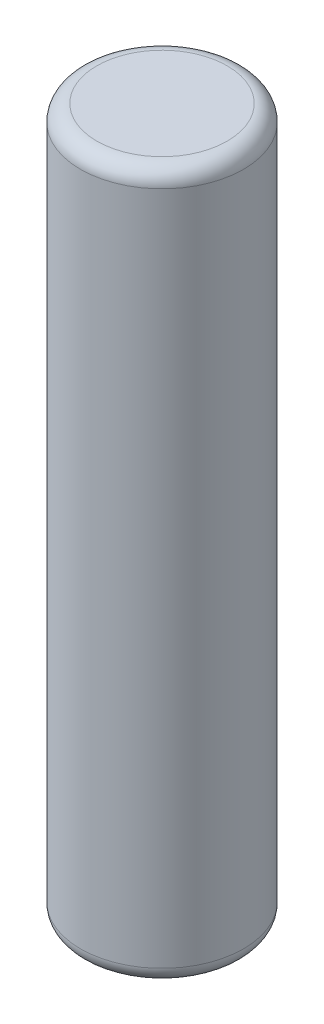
ISO-10303-21;
HEADER;
FILE_DESCRIPTION(('STEP AP214'),'2;1');
FILE_NAME('part.step','',(''),(''),'','','');
FILE_SCHEMA(('AUTOMOTIVE_DESIGN { 1 0 10303 214 1 1 1 1 }'));
ENDSEC;
DATA;
#1=APPLICATION_CONTEXT('core data for automotive mechanical design processes');
#2=APPLICATION_PROTOCOL_DEFINITION('international standard','automotive_design',2000,#1);
#3=PRODUCT_CONTEXT('',#1,'mechanical');
#4=PRODUCT('Part','Part','',(#3));
#5=PRODUCT_RELATED_PRODUCT_CATEGORY('part','',(#4));
#6=PRODUCT_DEFINITION_FORMATION('','',#4);
#7=PRODUCT_DEFINITION_CONTEXT('part definition',#1,'design');
#8=PRODUCT_DEFINITION('design','',#6,#7);
#9=PRODUCT_DEFINITION_SHAPE('','',#8);
#10=(LENGTH_UNIT() NAMED_UNIT(*) SI_UNIT(.MILLI.,.METRE.));
#11=(NAMED_UNIT(*) PLANE_ANGLE_UNIT() SI_UNIT($,.RADIAN.));
#12=(NAMED_UNIT(*) SI_UNIT($,.STERADIAN.) SOLID_ANGLE_UNIT());
#13=UNCERTAINTY_MEASURE_WITH_UNIT(LENGTH_MEASURE(1.E-05),#10,'distance_accuracy_value','');
#14=(GEOMETRIC_REPRESENTATION_CONTEXT(3) GLOBAL_UNCERTAINTY_ASSIGNED_CONTEXT((#13)) GLOBAL_UNIT_ASSIGNED_CONTEXT((#10,
#11,#12)) REPRESENTATION_CONTEXT('',''));
#15=CARTESIAN_POINT('',(0.,0.,0.));
#16=DIRECTION('',(0.,0.,1.));
#17=DIRECTION('',(1.,0.,0.));
#18=AXIS2_PLACEMENT_3D('',#15,#16,#17);
#19=CARTESIAN_POINT('',(0.,10.85,0.));
#20=DIRECTION('',(0.,1.,0.));
#21=DIRECTION('',(0.,0.,1.));
#22=AXIS2_PLACEMENT_3D('',#19,#20,#21);
#23=PLANE('',#22);
#24=CARTESIAN_POINT('',(0.,10.85,0.));
#25=DIRECTION('',(0.,-1.,0.));
#26=DIRECTION('',(0.,0.,-1.));
#27=AXIS2_PLACEMENT_3D('',#24,#25,#26);
#28=CIRCLE('',#27,2.);
#29=CARTESIAN_POINT('',(-1.15089779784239E-07,10.85,-2.));
#30=VERTEX_POINT('',#29);
#31=CARTESIAN_POINT('',(0.,10.85,2.));
#32=VERTEX_POINT('',#31);
#33=EDGE_CURVE('E50',#30,#32,#28,.T.);
#34=ORIENTED_EDGE('',*,*,#33,.F.);
#35=CARTESIAN_POINT('',(0.,10.85,2.));
#36=CARTESIAN_POINT('',(-0.0307999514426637,10.85,2.00000054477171));
#37=CARTESIAN_POINT('',(-0.0615998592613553,10.85,1.99928854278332));
#38=CARTESIAN_POINT('',(-0.123133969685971,10.85,1.99644335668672));
#39=CARTESIAN_POINT('',(-0.153868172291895,10.85,1.99431017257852));
#40=CARTESIAN_POINT('',(-0.215205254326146,10.85,1.98862653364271));
#41=CARTESIAN_POINT('',(-0.245808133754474,10.85,1.98507607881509));
#42=CARTESIAN_POINT('',(-0.306817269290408,10.85,1.97656564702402));
#43=CARTESIAN_POINT('',(-0.337223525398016,10.85,1.97160567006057));
#44=CARTESIAN_POINT('',(-0.397774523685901,10.85,1.96028673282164));
#45=CARTESIAN_POINT('',(-0.42791926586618,10.85,1.95392777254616));
#46=CARTESIAN_POINT('',(-0.487882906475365,10.85,1.93982445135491));
#47=CARTESIAN_POINT('',(-0.517701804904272,10.85,1.93208009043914));
#48=CARTESIAN_POINT('',(-0.576950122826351,10.85,1.91522249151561));
#49=CARTESIAN_POINT('',(-0.606379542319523,10.85,1.90610925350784));
#50=CARTESIAN_POINT('',(-0.66478609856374,10.85,1.8865333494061));
#51=CARTESIAN_POINT('',(-0.693763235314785,10.85,1.87607068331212));
#52=CARTESIAN_POINT('',(-0.751203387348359,10.85,1.8538182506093));
#53=CARTESIAN_POINT('',(-0.779666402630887,10.85,1.84202848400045));
#54=CARTESIAN_POINT('',(-0.83601757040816,10.85,1.81714701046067));
#55=CARTESIAN_POINT('',(-0.863905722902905,10.85,1.80405530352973));
#56=CARTESIAN_POINT('',(-0.919047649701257,10.85,1.77659788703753));
#57=CARTESIAN_POINT('',(-0.946301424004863,10.85,1.76223217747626));
#58=CARTESIAN_POINT('',(-1.00011643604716,10.85,1.732257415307));
#59=CARTESIAN_POINT('',(-1.02667767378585,10.8500000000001,1.71664836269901));
#60=CARTESIAN_POINT('',(-1.07905092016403,10.8499999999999,1.68422021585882));
#61=CARTESIAN_POINT('',(-1.10486292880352,10.8499999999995,1.66740112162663));
#62=CARTESIAN_POINT('',(-1.15568266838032,10.8500000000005,1.63258881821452));
#63=CARTESIAN_POINT('',(-1.18069039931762,10.8500000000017,1.61459560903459));
#64=CARTESIAN_POINT('',(-1.22984808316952,10.8499999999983,1.57747334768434));
#65=CARTESIAN_POINT('',(-1.25399803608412,10.8499999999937,1.55834429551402));
#66=CARTESIAN_POINT('',(-1.30138912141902,10.8500000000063,1.51899164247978));
#67=CARTESIAN_POINT('',(-1.32463025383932,10.8500000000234,1.49876804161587));
#68=CARTESIAN_POINT('',(-1.37015225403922,10.8499999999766,1.45726768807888));
#69=CARTESIAN_POINT('',(-1.39243312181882,10.8499999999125,1.43599093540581));
#70=CARTESIAN_POINT('',(-1.43688215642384,10.850000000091,1.39154816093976));
#71=CARTESIAN_POINT('',(-1.45900867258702,10.8500000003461,1.36834047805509));
#72=CARTESIAN_POINT('',(-1.50213538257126,10.8499999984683,1.32090020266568));
#73=CARTESIAN_POINT('',(-1.52313555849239,10.8499999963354,1.29666759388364));
#74=CARTESIAN_POINT('',(-1.56395781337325,10.8499999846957,1.24722956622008));
#75=CARTESIAN_POINT('',(-1.58377984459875,10.8499999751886,1.2220241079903));
#76=CARTESIAN_POINT('',(-1.62701591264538,10.8499999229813,1.16428316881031));
#77=CARTESIAN_POINT('',(-1.65008889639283,10.8499998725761,1.13149067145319));
#78=CARTESIAN_POINT('',(-1.68536870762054,10.8499997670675,1.077983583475));
#79=CARTESIAN_POINT('',(-1.69822539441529,10.8499997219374,1.05769380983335));
#80=CARTESIAN_POINT('',(-1.72733161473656,10.8499996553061,1.00980591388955));
#81=CARTESIAN_POINT('',(-1.74328379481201,10.8499996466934,0.98202583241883));
#82=CARTESIAN_POINT('',(-1.77378712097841,10.8499996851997,0.925711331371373));
#83=CARTESIAN_POINT('',(-1.78833833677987,10.849999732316,0.897176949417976));
#84=CARTESIAN_POINT('',(-1.81603206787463,10.8499998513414,0.839433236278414));
#85=CARTESIAN_POINT('',(-1.82917475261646,10.8499999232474,0.810223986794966));
#86=CARTESIAN_POINT('',(-1.84772365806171,10.8499999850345,0.765928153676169));
#87=CARTESIAN_POINT('',(-1.8537122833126,10.8499999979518,0.751082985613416));
#88=CARTESIAN_POINT('',(-1.86153325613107,10.8500000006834,0.731220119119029));
#89=CARTESIAN_POINT('',(-1.8634760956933,10.8500000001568,0.726245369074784));
#90=CARTESIAN_POINT('',(-1.87558557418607,10.8499999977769,0.694898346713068));
#91=CARTESIAN_POINT('',(-1.88525804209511,10.8499999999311,0.668332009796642));
#92=CARTESIAN_POINT('',(-1.90388221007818,10.8499999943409,0.613572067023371));
#93=CARTESIAN_POINT('',(-1.91277987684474,10.8499999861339,0.585360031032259));
#94=CARTESIAN_POINT('',(-1.92467876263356,10.849999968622,0.544508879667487));
#95=CARTESIAN_POINT('',(-1.9281869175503,10.8499999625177,0.53201498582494));
#96=CARTESIAN_POINT('',(-1.93954162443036,10.8499999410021,0.48999503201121));
#97=CARTESIAN_POINT('',(-1.94683018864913,10.8499999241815,0.460314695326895));
#98=CARTESIAN_POINT('',(-1.95753458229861,10.8499999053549,0.411889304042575));
#99=CARTESIAN_POINT('',(-1.96137510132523,10.8499999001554,0.393235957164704));
#100=CARTESIAN_POINT('',(-1.97186748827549,10.8499998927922,0.338249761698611));
#101=CARTESIAN_POINT('',(-1.97777111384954,10.8499998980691,0.301770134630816));
#102=CARTESIAN_POINT('',(-1.98655386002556,10.8499999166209,0.235866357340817));
#103=CARTESIAN_POINT('',(-1.98980172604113,10.8499999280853,0.206490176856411));
#104=CARTESIAN_POINT('',(-1.9949805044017,10.8499999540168,0.147622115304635));
#105=CARTESIAN_POINT('',(-1.99691147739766,10.8499999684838,0.118130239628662));
#106=CARTESIAN_POINT('',(-1.99944470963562,10.849999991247,0.0590917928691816));
#107=CARTESIAN_POINT('',(-2.00004705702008,10.8499999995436,0.0295452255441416));
#108=CARTESIAN_POINT('',(-1.99995287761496,10.850000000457,-0.0295860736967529));
#109=CARTESIAN_POINT('',(-1.99925454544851,10.849999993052,-0.0591708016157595));
#110=CARTESIAN_POINT('',(-1.99659363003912,10.8499999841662,-0.11828272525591));
#111=CARTESIAN_POINT('',(-1.99463110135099,10.8499999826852,-0.147809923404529));
#112=CARTESIAN_POINT('',(-1.98941982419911,10.8499999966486,-0.206748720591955));
#113=CARTESIAN_POINT('',(-1.98617105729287,10.8500000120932,-0.236160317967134));
#114=CARTESIAN_POINT('',(-1.97749488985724,10.849999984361,-0.302166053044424));
#115=CARTESIAN_POINT('',(-1.97172584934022,10.84999992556,-0.33871720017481));
#116=CARTESIAN_POINT('',(-1.96273050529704,10.8499998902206,-0.386207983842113));
#117=CARTESIAN_POINT('',(-1.96051255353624,10.8499998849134,-0.397343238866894));
#118=CARTESIAN_POINT('',(-1.95139296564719,10.8499998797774,-0.441075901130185));
#119=CARTESIAN_POINT('',(-1.94373113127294,10.8499999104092,-0.473519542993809));
#120=CARTESIAN_POINT('',(-1.93073337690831,10.8499999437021,-0.523015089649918));
#121=CARTESIAN_POINT('',(-1.9259687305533,10.8499999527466,-0.540220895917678));
#122=CARTESIAN_POINT('',(-1.91356248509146,10.8499999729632,-0.582791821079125));
#123=CARTESIAN_POINT('',(-1.9056442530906,10.8499999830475,-0.608077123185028));
#124=CARTESIAN_POINT('',(-1.88813803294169,10.8499999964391,-0.660323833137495));
#125=CARTESIAN_POINT('',(-1.87846714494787,10.8499999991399,-0.687257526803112));
#126=CARTESIAN_POINT('',(-1.86539159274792,10.8499999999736,-0.721395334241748));
#127=CARTESIAN_POINT('',(-1.86250535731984,10.8499999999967,-0.728800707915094));
#128=CARTESIAN_POINT('',(-1.85367058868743,10.8500000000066,-0.751089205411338));
#129=CARTESIAN_POINT('',(-1.84759179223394,10.8499999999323,-0.765920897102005));
#130=CARTESIAN_POINT('',(-1.82882794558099,10.8500000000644,-0.810191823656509));
#131=CARTESIAN_POINT('',(-1.81561463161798,10.8500000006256,-0.83940909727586));
#132=CARTESIAN_POINT('',(-1.78781952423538,10.8499999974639,-0.89718434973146));
#133=CARTESIAN_POINT('',(-1.77323769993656,10.849999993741,-0.925742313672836));
#134=CARTESIAN_POINT('',(-1.74273157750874,10.8499999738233,-0.982135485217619));
#135=CARTESIAN_POINT('',(-1.72680720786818,10.8499999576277,-1.00997065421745));
#136=CARTESIAN_POINT('',(-1.69780820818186,10.8499998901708,-1.05799798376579));
#137=CARTESIAN_POINT('',(-1.68501598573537,10.8499998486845,-1.07836172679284));
#138=CARTESIAN_POINT('',(-1.64994545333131,10.8499997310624,-1.13198511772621));
#139=CARTESIAN_POINT('',(-1.62701252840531,10.8499996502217,-1.16482160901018));
#140=CARTESIAN_POINT('',(-1.58392733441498,10.8499996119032,-1.22257302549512));
#141=CARTESIAN_POINT('',(-1.56413598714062,10.8499996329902,-1.24775901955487));
#142=CARTESIAN_POINT('',(-1.52334696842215,10.8499997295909,-1.29713448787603));
#143=CARTESIAN_POINT('',(-1.50234940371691,10.8499998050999,-1.32132404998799));
#144=CARTESIAN_POINT('',(-1.45911905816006,10.8499999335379,-1.36856239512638));
#145=CARTESIAN_POINT('',(-1.43688648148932,10.8499999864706,-1.3916113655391));
#146=CARTESIAN_POINT('',(-1.40134319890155,10.8500000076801,-1.42704377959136));
#147=CARTESIAN_POINT('',(-1.3883308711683,10.8500000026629,-1.43973009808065));
#148=CARTESIAN_POINT('',(-1.35976484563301,10.8499999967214,-1.46683969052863));
#149=CARTESIAN_POINT('',(-1.34414996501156,10.8499999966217,-1.48119877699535));
#150=CARTESIAN_POINT('',(-1.3065663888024,10.8499999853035,-1.51468185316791));
#151=CARTESIAN_POINT('',(-1.28440035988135,10.8499999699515,-1.5335852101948));
#152=CARTESIAN_POINT('',(-1.24926888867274,10.8499999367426,-1.56224229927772));
#153=CARTESIAN_POINT('',(-1.23658046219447,10.8499999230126,-1.57233750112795));
#154=CARTESIAN_POINT('',(-1.21188772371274,10.8499998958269,-1.59149256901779));
#155=CARTESIAN_POINT('',(-1.19990045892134,10.8499998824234,-1.60057445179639));
#156=CARTESIAN_POINT('',(-1.15847507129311,10.8499998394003,-1.63122006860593));
#157=CARTESIAN_POINT('',(-1.12853295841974,10.849999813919,-1.65211102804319));
#158=CARTESIAN_POINT('',(-1.07796303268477,10.8499998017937,-1.68533489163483));
#159=CARTESIAN_POINT('',(-1.05765012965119,10.8499998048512,-1.69815205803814));
#160=CARTESIAN_POINT('',(-1.00972466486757,10.8499998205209,-1.72718749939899));
#161=CARTESIAN_POINT('',(-0.981935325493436,10.8499998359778,-1.74311579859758));
#162=CARTESIAN_POINT('',(-0.925617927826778,10.8499998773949,-1.77360117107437));
#163=CARTESIAN_POINT('',(-0.897089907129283,10.8499999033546,-1.78815831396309));
#164=CARTESIAN_POINT('',(-0.839361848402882,10.8499999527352,-1.81587102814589));
#165=CARTESIAN_POINT('',(-0.810161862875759,10.8499999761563,-1.82902670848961));
#166=CARTESIAN_POINT('',(-0.765910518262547,10.8499999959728,-1.84767908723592));
#167=CARTESIAN_POINT('',(-0.751084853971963,10.8500000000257,-1.85371635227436));
#168=CARTESIAN_POINT('',(-0.722428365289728,10.8499999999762,-1.86499055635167));
#169=CARTESIAN_POINT('',(-0.708607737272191,10.8499999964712,-1.87025343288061));
#170=CARTESIAN_POINT('',(-0.666983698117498,10.8499999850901,-1.88559598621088));
#171=CARTESIAN_POINT('',(-0.639014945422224,10.8499999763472,-1.89523091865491));
#172=CARTESIAN_POINT('',(-0.582691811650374,10.8499999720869,-1.91329419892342));
#173=CARTESIAN_POINT('',(-0.554337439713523,10.8499999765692,-1.92172257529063));
#174=CARTESIAN_POINT('',(-0.497288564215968,10.8500000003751,-1.93734012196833));
#175=CARTESIAN_POINT('',(-0.468594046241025,10.8500000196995,-1.94452923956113));
#176=CARTESIAN_POINT('',(-0.418139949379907,10.8499999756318,-1.95607889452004));
#177=CARTESIAN_POINT('',(-0.396439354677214,10.8499999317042,-1.96069732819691));
#178=CARTESIAN_POINT('',(-0.350294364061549,10.8499998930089,-1.96958814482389));
#179=CARTESIAN_POINT('',(-0.325829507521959,10.8499999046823,-1.9737546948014));
#180=CARTESIAN_POINT('',(-0.263993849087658,10.8499999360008,-1.98310930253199));
#181=CARTESIAN_POINT('',(-0.226532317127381,10.8499999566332,-1.98770057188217));
#182=CARTESIAN_POINT('',(-0.147707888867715,10.8499999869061,-1.99509333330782));
#183=CARTESIAN_POINT('',(-0.106324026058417,10.8499999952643,-1.99767409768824));
#184=CARTESIAN_POINT('',(-0.0432752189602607,10.8500000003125,-1.99966843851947));
#185=CARTESIAN_POINT('',(-0.0216364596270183,10.8500000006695,-2.00000613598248));
#186=CARTESIAN_POINT('',(-1.91816298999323E-07,10.85,-2.));
#187=B_SPLINE_CURVE_WITH_KNOTS('',3,(#35,#36,#37,#38,#39,#40,#41,#42,#43,#44,#45,#46,#47,#48,
#49,#50,#51,#52,#53,#54,#55,#56,#57,#58,#59,#60,#61,#62,#63,#64,#65,#66,#67,#68,#69,#70,#71,#72,
#73,#74,#75,#76,#77,#78,#79,#80,#81,#82,#83,#84,#85,#86,#87,#88,#89,#90,#91,#92,#93,#94,#95,#96,
#97,#98,#99,#100,#101,#102,#103,#104,#105,#106,#107,#108,#109,#110,#111,#112,#113,#114,#115,
#116,#117,#118,#119,#120,#121,#122,#123,#124,#125,#126,#127,#128,#129,#130,#131,#132,#133,#134,
#135,#136,#137,#138,#139,#140,#141,#142,#143,#144,#145,#146,#147,#148,#149,#150,#151,#152,#153,
#154,#155,#156,#157,#158,#159,#160,#161,#162,#163,#164,#165,#166,#167,#168,#169,#170,#171,#172,
#173,#174,#175,#176,#177,#178,#179,#180,#181,#182,#183,#184,#185,#186),.UNSPECIFIED.,.F.,.F.,(4,
2,2,2,2,2,2,2,2,2,2,2,2,2,2,2,2,2,2,2,2,2,2,2,2,2,2,2,2,2,2,2,2,2,2,2,2,2,2,2,2,2,2,2,2,2,2,2,2,
2,2,2,2,2,2,2,2,2,2,2,2,2,2,2,2,2,2,2,2,2,2,2,2,2,2,4),(0.,0.0923915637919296,0.184783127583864,
0.277174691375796,0.369566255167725,0.461957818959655,0.554349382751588,0.646740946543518,
0.739132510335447,0.831524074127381,0.923915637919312,1.01630720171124,1.10869876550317,
1.2010903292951,1.29348189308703,1.38587345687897,1.4782650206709,1.57065658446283,
1.66681594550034,1.76297683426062,1.85914161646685,1.97935029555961,2.05139766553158,
2.14745778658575,2.24351312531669,2.33955689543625,2.38757600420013,2.40359807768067,
2.48838908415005,2.57710208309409,2.61603214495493,2.70767819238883,2.76480676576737,
2.87560284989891,2.96424148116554,3.05287602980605,3.14150469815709,3.23025647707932,
3.31900442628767,3.40775364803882,3.51869490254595,3.55275605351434,3.65270998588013,
3.70626575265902,3.78573217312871,3.87155512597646,3.89539871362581,3.94348181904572,
4.03964104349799,4.13580243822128,4.23196895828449,4.30410195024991,4.42417070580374,
4.5202306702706,4.61628214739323,4.71231779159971,4.76683344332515,4.83046301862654,
4.917828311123,4.96646723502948,5.01158185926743,5.12104373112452,5.19308679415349,
5.28913789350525,5.38518411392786,5.48122285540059,5.52924215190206,5.57360546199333,
5.66232172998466,5.75103589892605,5.83975384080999,5.90630053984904,5.98073176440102,
6.0938972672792,6.2182049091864,6.28311682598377),.UNSPECIFIED.);
#188=EDGE_CURVE('E45',#32,#30,#187,.T.);
#189=ORIENTED_EDGE('',*,*,#188,.F.);
#190=EDGE_LOOP('',(#34,#189));
#191=FACE_BOUND('',#190,.T.);
#192=ADVANCED_FACE('F16',(#191),#23,.T.);
#193=CARTESIAN_POINT('',(0.,-10.85,0.));
#194=DIRECTION('',(0.,1.,0.));
#195=DIRECTION('',(0.,0.,1.));
#196=AXIS2_PLACEMENT_3D('',#193,#194,#195);
#197=PLANE('',#196);
#198=CARTESIAN_POINT('',(2.66342503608E-13,-10.85,0.));
#199=DIRECTION('',(0.,1.,0.));
#200=DIRECTION('',(-1.33060229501E-13,0.,1.));
#201=AXIS2_PLACEMENT_3D('',#198,#199,#200);
#202=CIRCLE('',#201,2.00000000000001);
#203=CARTESIAN_POINT('',(0.,-10.85,1.99999999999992));
#204=VERTEX_POINT('',#203);
#205=CARTESIAN_POINT('',(1.7009559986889E-07,-10.85,-2.00000000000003));
#206=VERTEX_POINT('',#205);
#207=EDGE_CURVE('E56',#204,#206,#202,.T.);
#208=ORIENTED_EDGE('',*,*,#207,.F.);
#209=CARTESIAN_POINT('',(2.83492646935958E-07,-10.85,-2.));
#210=CARTESIAN_POINT('',(-0.0273470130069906,-10.8499999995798,-2.00000047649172));
#211=CARTESIAN_POINT('',(-0.0546943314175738,-10.8499999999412,-1.99944420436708));
#212=CARTESIAN_POINT('',(-0.109344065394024,-10.849999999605,-1.99722095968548));
#213=CARTESIAN_POINT('',(-0.136646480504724,-10.8499999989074,-1.99555397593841));
#214=CARTESIAN_POINT('',(-0.191161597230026,-10.8499999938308,-1.99111204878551));
#215=CARTESIAN_POINT('',(-0.218374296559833,-10.8499999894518,-1.98833707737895));
#216=CARTESIAN_POINT('',(-0.272665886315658,-10.8499999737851,-1.98168167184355));
#217=CARTESIAN_POINT('',(-0.299744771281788,-10.8499999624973,-1.97780119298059));
#218=CARTESIAN_POINT('',(-0.346975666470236,-10.8499999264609,-1.97005547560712));
#219=CARTESIAN_POINT('',(-0.367167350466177,-10.849999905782,-1.96642884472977));
#220=CARTESIAN_POINT('',(-0.420874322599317,-10.849999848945,-1.95591550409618));
#221=CARTESIAN_POINT('',(-0.454282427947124,-10.849999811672,-1.94846904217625));
#222=CARTESIAN_POINT('',(-0.514018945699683,-10.8499997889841,-1.93348771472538));
#223=CARTESIAN_POINT('',(-0.540427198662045,-10.8499997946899,-1.92626827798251));
#224=CARTESIAN_POINT('',(-0.592913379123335,-10.8499998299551,-1.91071899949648));
#225=CARTESIAN_POINT('',(-0.61899132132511,-10.8499998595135,-1.9023892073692));
#226=CARTESIAN_POINT('',(-0.67078002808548,-10.8499999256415,-1.88465902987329));
#227=CARTESIAN_POINT('',(-0.696490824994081,-10.8499999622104,-1.87525873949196));
#228=CARTESIAN_POINT('',(-0.734715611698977,-10.8499999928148,-1.86029525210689));
#229=CARTESIAN_POINT('',(-0.747400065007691,-10.8499999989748,-1.85516368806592));
#230=CARTESIAN_POINT('',(-0.763873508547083,-10.8500000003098,-1.84837730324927));
#231=CARTESIAN_POINT('',(-0.76769287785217,-10.8500000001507,-1.84679530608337));
#232=CARTESIAN_POINT('',(-0.79384815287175,-10.849999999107,-1.8358723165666));
#233=CARTESIAN_POINT('',(-0.816030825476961,-10.8499999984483,-1.82616075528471));
#234=CARTESIAN_POINT('',(-0.873124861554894,-10.8499999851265,-1.79991705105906));
#235=CARTESIAN_POINT('',(-0.907753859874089,-10.849999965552,-1.78276573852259));
#236=CARTESIAN_POINT('',(-0.971639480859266,-10.8499999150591,-1.74878005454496));
#237=CARTESIAN_POINT('',(-1.00102137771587,-10.8499998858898,-1.73218027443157));
#238=CARTESIAN_POINT('',(-1.05268007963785,-10.8499998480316,-1.70121434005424));
#239=CARTESIAN_POINT('',(-1.07512798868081,-10.8499998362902,-1.68713378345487));
#240=CARTESIAN_POINT('',(-1.10238695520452,-10.8499998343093,-1.66925391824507));
#241=CARTESIAN_POINT('',(-1.10747927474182,-10.8499998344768,-1.66587950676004));
#242=CARTESIAN_POINT('',(-1.13007142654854,-10.84999983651,-1.65075750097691));
#243=CARTESIAN_POINT('',(-1.14740002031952,-10.8499998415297,-1.63875246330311));
#244=CARTESIAN_POINT('',(-1.18737668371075,-10.8499998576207,-1.61010483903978));
#245=CARTESIAN_POINT('',(-1.20987296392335,-10.8499998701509,-1.59325005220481));
#246=CARTESIAN_POINT('',(-1.25412488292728,-10.8499998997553,-1.55859734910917));
#247=CARTESIAN_POINT('',(-1.27588055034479,-10.8499999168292,-1.54079946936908));
#248=CARTESIAN_POINT('',(-1.31862427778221,-10.8499999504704,-1.504305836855));
#249=CARTESIAN_POINT('',(-1.33961237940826,-10.8499999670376,-1.48561013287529));
#250=CARTESIAN_POINT('',(-1.3807373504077,-10.8499999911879,-1.44730817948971));
#251=CARTESIAN_POINT('',(-1.40087427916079,-10.8499999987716,-1.42770199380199));
#252=CARTESIAN_POINT('',(-1.42828576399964,-10.8500000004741,-1.40004298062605));
#253=CARTESIAN_POINT('',(-1.43586542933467,-10.8500000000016,-1.39228873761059));
#254=CARTESIAN_POINT('',(-1.46399225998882,-10.8499999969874,-1.36303746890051));
#255=CARTESIAN_POINT('',(-1.48412261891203,-10.8499999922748,-1.3411364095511));
#256=CARTESIAN_POINT('',(-1.52542119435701,-10.8499999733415,-1.29415347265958));
#257=CARTESIAN_POINT('',(-1.54648172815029,-10.8499999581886,-1.26897675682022));
#258=CARTESIAN_POINT('',(-1.57197180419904,-10.8499999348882,-1.23692865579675));
#259=CARTESIAN_POINT('',(-1.57699922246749,-10.8499999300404,-1.23052765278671));
#260=CARTESIAN_POINT('',(-1.5988999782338,-10.8499999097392,-1.20228447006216));
#261=CARTESIAN_POINT('',(-1.61535613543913,-10.8499998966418,-1.18011573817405));
#262=CARTESIAN_POINT('',(-1.64652392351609,-10.8499998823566,-1.13623040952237));
#263=CARTESIAN_POINT('',(-1.66128163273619,-10.849999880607,-1.11454649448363));
#264=CARTESIAN_POINT('',(-1.68150211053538,-10.8499998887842,-1.08351358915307));
#265=CARTESIAN_POINT('',(-1.68733193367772,-10.8499998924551,-1.07440218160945));
#266=CARTESIAN_POINT('',(-1.70767963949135,-10.8499999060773,-1.04202200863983));
#267=CARTESIAN_POINT('',(-1.72179255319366,-10.8499999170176,-1.01849737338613));
#268=CARTESIAN_POINT('',(-1.75592685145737,-10.8499999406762,-0.958856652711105));
#269=CARTESIAN_POINT('',(-1.77533031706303,-10.8499999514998,-0.922384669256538));
#270=CARTESIAN_POINT('',(-1.80806797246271,-10.8499999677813,-0.855969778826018));
#271=CARTESIAN_POINT('',(-1.821827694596,-10.8499999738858,-0.826235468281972));
#272=CARTESIAN_POINT('',(-1.84448170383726,-10.8499999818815,-0.773960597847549));
#273=CARTESIAN_POINT('',(-1.85370957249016,-10.8499999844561,-0.751564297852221));
#274=CARTESIAN_POINT('',(-1.86823840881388,-10.8499999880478,-0.714400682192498));
#275=CARTESIAN_POINT('',(-1.87377728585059,-10.849999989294,-0.699726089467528));
#276=CARTESIAN_POINT('',(-1.88142934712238,-10.8499999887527,-0.678743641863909));
#277=CARTESIAN_POINT('',(-1.88367819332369,-10.849999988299,-0.672484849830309));
#278=CARTESIAN_POINT('',(-1.89649984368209,-10.8499999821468,-0.636262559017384));
#279=CARTESIAN_POINT('',(-1.90642622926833,-10.8499999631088,-0.606065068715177));
#280=CARTESIAN_POINT('',(-1.92364215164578,-10.8499999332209,-0.54902430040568));
#281=CARTESIAN_POINT('',(-1.93110618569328,-10.8499999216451,-0.52223333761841));
#282=CARTESIAN_POINT('',(-1.94490563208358,-10.8499999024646,-0.468361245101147));
#283=CARTESIAN_POINT('',(-1.95124101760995,-10.84999989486,-0.44128010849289));
#284=CARTESIAN_POINT('',(-1.96276476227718,-10.8499998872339,-0.3868747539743));
#285=CARTESIAN_POINT('',(-1.96795311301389,-10.8499998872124,-0.35955053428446));
#286=CARTESIAN_POINT('',(-1.97717647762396,-10.8499998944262,-0.30470826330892));
#287=CARTESIAN_POINT('',(-1.98121150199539,-10.8499999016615,-0.277190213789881));
#288=CARTESIAN_POINT('',(-1.98811610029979,-10.8499999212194,-0.222009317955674));
#289=CARTESIAN_POINT('',(-1.99098570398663,-10.8499999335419,-0.194346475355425));
#290=CARTESIAN_POINT('',(-1.99557107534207,-10.8499999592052,-0.138925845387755));
#291=CARTESIAN_POINT('',(-1.99728689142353,-10.8499999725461,-0.11116806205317));
#292=CARTESIAN_POINT('',(-1.99949988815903,-10.8499999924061,-0.0556059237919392));
#293=CARTESIAN_POINT('',(-1.99999713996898,-10.8499999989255,-0.0278015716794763));
#294=CARTESIAN_POINT('',(-2.00000117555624,-10.8500000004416,0.0114270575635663));
#295=CARTESIAN_POINT('',(-1.99991882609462,-10.8499999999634,0.0228537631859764));
#296=CARTESIAN_POINT('',(-1.99925230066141,-10.8499999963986,0.0649461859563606));
#297=CARTESIAN_POINT('',(-1.99805656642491,-10.8499999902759,0.0956047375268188));
#298=CARTESIAN_POINT('',(-1.99407562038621,-10.8499999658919,0.159851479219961));
#299=CARTESIAN_POINT('',(-1.99114546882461,-10.8499999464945,0.193430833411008));
#300=CARTESIAN_POINT('',(-1.98642259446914,-10.8499999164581,0.23527280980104));
#301=CARTESIAN_POINT('',(-1.98542565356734,-10.8499999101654,0.243629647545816));
#302=CARTESIAN_POINT('',(-1.98081619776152,-10.8499998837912,0.280267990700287));
#303=CARTESIAN_POINT('',(-1.97664202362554,-10.8499998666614,0.308481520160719));
#304=CARTESIAN_POINT('',(-1.96731824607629,-10.8499998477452,0.363252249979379));
#305=CARTESIAN_POINT('',(-1.9622299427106,-10.8499998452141,0.389819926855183));
#306=CARTESIAN_POINT('',(-1.95427097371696,-10.8499998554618,0.427164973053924));
#307=CARTESIAN_POINT('',(-1.95185571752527,-10.849999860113,0.438040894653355));
#308=CARTESIAN_POINT('',(-1.94288598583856,-10.849999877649,0.476885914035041));
#309=CARTESIAN_POINT('',(-1.93581578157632,-10.8499998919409,0.504737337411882));
#310=CARTESIAN_POINT('',(-1.91668346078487,-10.849999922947,0.573836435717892));
#311=CARTESIAN_POINT('',(-1.90388396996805,-10.849999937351,0.614882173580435));
#312=CARTESIAN_POINT('',(-1.87872071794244,-10.8499999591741,0.687280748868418));
#313=CARTESIAN_POINT('',(-1.86686129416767,-10.8499999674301,0.718810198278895));
#314=CARTESIAN_POINT('',(-1.84505942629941,-10.8499999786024,0.772618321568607));
#315=CARTESIAN_POINT('',(-1.83549102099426,-10.8499999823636,0.795048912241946));
#316=CARTESIAN_POINT('',(-1.81934211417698,-10.8499999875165,0.83106498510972));
#317=CARTESIAN_POINT('',(-1.81301270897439,-10.849999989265,0.844763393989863));
#318=CARTESIAN_POINT('',(-1.80415754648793,-10.849999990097,0.863391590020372));
#319=CARTESIAN_POINT('',(-1.80176031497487,-10.8499999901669,0.868382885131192));
#320=CARTESIAN_POINT('',(-1.78591122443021,-10.8499999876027,0.901058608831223));
#321=CARTESIAN_POINT('',(-1.7718823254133,-10.8499999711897,0.92846843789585));
#322=CARTESIAN_POINT('',(-1.74436986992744,-10.8499999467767,0.979205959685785));
#323=CARTESIAN_POINT('',(-1.73103719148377,-10.8499999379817,1.00261578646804));
#324=CARTESIAN_POINT('',(-1.70343424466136,-10.8499999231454,1.04887692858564));
#325=CARTESIAN_POINT('',(-1.68916395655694,-10.8499999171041,1.07172823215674));
#326=CARTESIAN_POINT('',(-1.65970233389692,-10.8499999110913,1.11682936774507));
#327=CARTESIAN_POINT('',(-1.64451099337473,-10.8499999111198,1.13907919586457));
#328=CARTESIAN_POINT('',(-1.61323527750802,-10.8499999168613,1.18294189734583));
#329=CARTESIAN_POINT('',(-1.59715090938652,-10.8499999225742,1.20455477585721));
#330=CARTESIAN_POINT('',(-1.56411318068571,-10.8499999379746,1.24710477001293));
#331=CARTESIAN_POINT('',(-1.54715983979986,-10.849999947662,1.26804190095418));
#332=CARTESIAN_POINT('',(-1.5124217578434,-10.8499999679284,1.30921393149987));
#333=CARTESIAN_POINT('',(-1.49463704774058,-10.8499999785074,1.32944885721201));
#334=CARTESIAN_POINT('',(-1.45823245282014,-10.8499999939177,1.36915087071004));
#335=CARTESIAN_POINT('',(-1.43961261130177,-10.8499999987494,1.38861799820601));
#336=CARTESIAN_POINT('',(-1.41037089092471,-10.8500000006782,1.41811737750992));
#337=CARTESIAN_POINT('',(-1.39998892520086,-10.8500000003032,1.42838988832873));
#338=CARTESIAN_POINT('',(-1.36479936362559,-10.8499999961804,1.46245922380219));
#339=CARTESIAN_POINT('',(-1.33948690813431,-10.8499999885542,1.48574145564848));
#340=CARTESIAN_POINT('',(-1.3000473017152,-10.8499999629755,1.52019013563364));
#341=CARTESIAN_POINT('',(-1.28633958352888,-10.8499999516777,1.53184192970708));
#342=CARTESIAN_POINT('',(-1.25763540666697,-10.8499999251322,1.55557835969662));
#343=CARTESIAN_POINT('',(-1.24261623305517,-10.8499999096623,1.56763557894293));
#344=CARTESIAN_POINT('',(-1.20522597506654,-10.8499998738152,1.59676216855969));
#345=CARTESIAN_POINT('',(-1.18265761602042,-10.8499998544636,1.61357966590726));
#346=CARTESIAN_POINT('',(-1.14431094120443,-10.8499998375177,1.64089132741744));
#347=CARTESIAN_POINT('',(-1.12872385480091,-10.8499998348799,1.65165590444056));
#348=CARTESIAN_POINT('',(-1.08379437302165,-10.8499998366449,1.68173714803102));
#349=CARTESIAN_POINT('',(-1.05407894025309,-10.8499998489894,1.70050187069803));
#350=CARTESIAN_POINT('',(-0.999737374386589,-10.8499998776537,1.7328351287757));
#351=CARTESIAN_POINT('',(-0.975281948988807,-10.8499998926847,1.74669232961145));
#352=CARTESIAN_POINT('',(-0.925803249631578,-10.8499999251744,1.77335083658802));
#353=CARTESIAN_POINT('',(-0.900780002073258,-10.849999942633,1.78615219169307));
#354=CARTESIAN_POINT('',(-0.850217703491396,-10.8499999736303,1.81069101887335));
#355=CARTESIAN_POINT('',(-0.824678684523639,-10.8499999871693,1.82242855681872));
#356=CARTESIAN_POINT('',(-0.786002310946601,-10.8499999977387,1.83917874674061));
#357=CARTESIAN_POINT('',(-0.773048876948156,-10.8499999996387,1.84461945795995));
#358=CARTESIAN_POINT('',(-0.755799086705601,-10.8500000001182,1.85169642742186));
#359=CARTESIAN_POINT('',(-0.751542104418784,-10.8500000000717,1.85342938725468));
#360=CARTESIAN_POINT('',(-0.725189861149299,-10.8499999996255,1.86405741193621));
#361=CARTESIAN_POINT('',(-0.702949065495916,-10.8499999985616,1.87259510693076));
#362=CARTESIAN_POINT('',(-0.64593665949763,-10.8499999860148,1.89331817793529));
#363=CARTESIAN_POINT('',(-0.610960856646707,-10.8499999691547,1.90494644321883));
#364=CARTESIAN_POINT('',(-0.544108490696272,-10.8499999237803,1.92513620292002));
#365=CARTESIAN_POINT('',(-0.51229005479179,-10.8499998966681,1.93389119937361));
#366=CARTESIAN_POINT('',(-0.449540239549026,-10.8499998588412,1.94946800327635));
#367=CARTESIAN_POINT('',(-0.418624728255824,-10.8499998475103,1.95635345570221));
#368=CARTESIAN_POINT('',(-0.367423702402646,-10.8499998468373,1.96646542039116));
#369=CARTESIAN_POINT('',(-0.347222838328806,-10.8499998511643,1.97012718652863));
#370=CARTESIAN_POINT('',(-0.29996618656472,-10.8499998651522,1.97793814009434));
#371=CARTESIAN_POINT('',(-0.272869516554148,-10.8499998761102,1.98184307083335));
#372=CARTESIAN_POINT('',(-0.218539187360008,-10.8499999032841,1.98852615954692));
#373=CARTESIAN_POINT('',(-0.191305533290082,-10.8499999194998,1.99130435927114));
#374=CARTESIAN_POINT('',(-0.136747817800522,-10.8499999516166,1.99572999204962));
#375=CARTESIAN_POINT('',(-0.109423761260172,-10.8499999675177,1.99737748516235));
#376=CARTESIAN_POINT('',(-0.0547327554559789,-10.8499999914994,1.9995392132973));
#377=CARTESIAN_POINT('',(-0.0273658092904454,-10.8499999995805,2.00005352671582));
#378=CARTESIAN_POINT('',(0.,-10.85,2.));
#379=B_SPLINE_CURVE_WITH_KNOTS('',3,(#209,#210,#211,#212,#213,#214,#215,#216,#217,#218,#219,
#220,#221,#222,#223,#224,#225,#226,#227,#228,#229,#230,#231,#232,#233,#234,#235,#236,#237,#238,
#239,#240,#241,#242,#243,#244,#245,#246,#247,#248,#249,#250,#251,#252,#253,#254,#255,#256,#257,
#258,#259,#260,#261,#262,#263,#264,#265,#266,#267,#268,#269,#270,#271,#272,#273,#274,#275,#276,
#277,#278,#279,#280,#281,#282,#283,#284,#285,#286,#287,#288,#289,#290,#291,#292,#293,#294,#295,
#296,#297,#298,#299,#300,#301,#302,#303,#304,#305,#306,#307,#308,#309,#310,#311,#312,#313,#314,
#315,#316,#317,#318,#319,#320,#321,#322,#323,#324,#325,#326,#327,#328,#329,#330,#331,#332,#333,
#334,#335,#336,#337,#338,#339,#340,#341,#342,#343,#344,#345,#346,#347,#348,#349,#350,#351,#352,
#353,#354,#355,#356,#357,#358,#359,#360,#361,#362,#363,#364,#365,#366,#367,#368,#369,#370,#371,
#372,#373,#374,#375,#376,#377,#378),.UNSPECIFIED.,.F.,.F.,(4,2,2,2,2,2,2,2,2,2,2,2,2,2,2,2,2,2,
2,2,2,2,2,2,2,2,2,2,2,2,2,2,2,2,2,2,2,2,2,2,2,2,2,2,2,2,2,2,2,2,2,2,2,2,2,2,2,2,2,2,2,2,2,2,2,2,
2,2,2,2,2,2,2,2,2,2,2,2,2,2,2,2,2,2,4),(0.,0.0820362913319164,0.164073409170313,
0.246112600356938,0.328155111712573,0.389691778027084,0.492322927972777,0.574431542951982,
0.656536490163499,0.738634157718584,0.779681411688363,0.792083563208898,0.864714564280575,
0.980575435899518,1.08177343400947,1.16124479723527,1.1795713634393,1.24280239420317,
1.32710585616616,1.41140605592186,1.49570167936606,1.57999141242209,1.61252124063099,
1.70173064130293,1.80015778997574,1.82457548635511,1.90737513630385,1.98604106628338,
2.01849068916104,2.1007672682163,2.22461865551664,2.32287148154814,2.39552406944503,
2.44257499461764,2.46252664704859,2.55784623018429,2.64125641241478,2.7246685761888,
2.80808135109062,2.89149336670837,2.97490325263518,3.05830963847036,3.14171115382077,
3.17599161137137,3.26800244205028,3.36907481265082,3.39432295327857,3.4798546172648,
3.56098173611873,3.59440330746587,3.6805810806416,3.80947019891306,3.91048684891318,
3.98362897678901,4.02889497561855,4.04550639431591,4.13784280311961,4.21864201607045,
4.29944292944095,4.3802443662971,4.46104514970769,4.54184410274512,4.62264004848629,
4.70343181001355,4.74724586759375,4.85036501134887,4.90433210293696,4.96210475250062,
5.04651118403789,5.10333407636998,5.20871057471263,5.29301254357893,5.37731060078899,
5.46160343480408,5.50374986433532,5.5175384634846,5.58899351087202,5.69950730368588,
5.79847100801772,5.89344999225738,5.95503177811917,6.03713665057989,6.11923848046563,
6.2013359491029,6.28342773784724),.UNSPECIFIED.);
#380=EDGE_CURVE('E36',#206,#204,#379,.T.);
#381=ORIENTED_EDGE('',*,*,#380,.F.);
#382=EDGE_LOOP('',(#208,#381));
#383=FACE_BOUND('',#382,.T.);
#384=ADVANCED_FACE('F73',(#383),#197,.F.);
#385=CARTESIAN_POINT('',(0.,10.35,0.));
#386=DIRECTION('',(0.,1.,0.));
#387=DIRECTION('',(0.,0.,1.));
#388=AXIS2_PLACEMENT_3D('',#385,#386,#387);
#389=TOROIDAL_SURFACE('',#388,2.,0.5);
#390=CARTESIAN_POINT('',(0.,10.35,0.));
#391=DIRECTION('',(0.,1.,0.));
#392=DIRECTION('',(0.,0.,1.));
#393=AXIS2_PLACEMENT_3D('',#390,#391,#392);
#394=CIRCLE('',#393,2.5);
#395=CARTESIAN_POINT('',(0.,10.35,2.5));
#396=VERTEX_POINT('',#395);
#397=EDGE_CURVE('E28',#396,#396,#394,.F.);
#398=ORIENTED_EDGE('',*,*,#397,.F.);
#399=EDGE_LOOP('',(#398));
#400=FACE_BOUND('',#399,.T.);
#401=ORIENTED_EDGE('',*,*,#33,.T.);
#402=ORIENTED_EDGE('',*,*,#188,.T.);
#403=EDGE_LOOP('',(#401,#402));
#404=FACE_BOUND('',#403,.T.);
#405=ADVANCED_FACE('F55',(#400,#404),#389,.T.);
#406=CARTESIAN_POINT('',(2.66342503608E-13,-10.35,0.));
#407=DIRECTION('',(0.,1.,0.));
#408=DIRECTION('',(-1.33060229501E-13,0.,1.));
#409=AXIS2_PLACEMENT_3D('',#406,#407,#408);
#410=TOROIDAL_SURFACE('',#409,2.,0.5);
#411=ORIENTED_EDGE('',*,*,#207,.T.);
#412=ORIENTED_EDGE('',*,*,#380,.T.);
#413=EDGE_LOOP('',(#411,#412));
#414=FACE_BOUND('',#413,.T.);
#415=CARTESIAN_POINT('',(0.,-10.35,0.));
#416=DIRECTION('',(0.,1.,0.));
#417=DIRECTION('',(0.,0.,1.));
#418=AXIS2_PLACEMENT_3D('',#415,#416,#417);
#419=CIRCLE('',#418,2.5);
#420=CARTESIAN_POINT('',(0.,-10.35,2.5));
#421=VERTEX_POINT('',#420);
#422=EDGE_CURVE('E11',#421,#421,#419,.T.);
#423=ORIENTED_EDGE('',*,*,#422,.F.);
#424=EDGE_LOOP('',(#423));
#425=FACE_BOUND('',#424,.T.);
#426=ADVANCED_FACE('F72',(#414,#425),#410,.T.);
#427=CARTESIAN_POINT('',(0.,0.,0.));
#428=DIRECTION('',(0.,1.,0.));
#429=DIRECTION('',(0.,0.,1.));
#430=AXIS2_PLACEMENT_3D('',#427,#428,#429);
#431=CYLINDRICAL_SURFACE('',#430,2.5);
#432=ORIENTED_EDGE('',*,*,#397,.T.);
#433=EDGE_LOOP('',(#432));
#434=FACE_BOUND('',#433,.T.);
#435=ORIENTED_EDGE('',*,*,#422,.T.);
#436=EDGE_LOOP('',(#435));
#437=FACE_BOUND('',#436,.T.);
#438=ADVANCED_FACE('F120',(#434,#437),#431,.T.);
#439=CLOSED_SHELL('',(#192,#384,#405,#426,#438));
#440=MANIFOLD_SOLID_BREP('B1',#439);
#441=ADVANCED_BREP_SHAPE_REPRESENTATION('',(#18,#440),#14);
#442=SHAPE_DEFINITION_REPRESENTATION(#9,#441);
ENDSEC;
END-ISO-10303-21;
